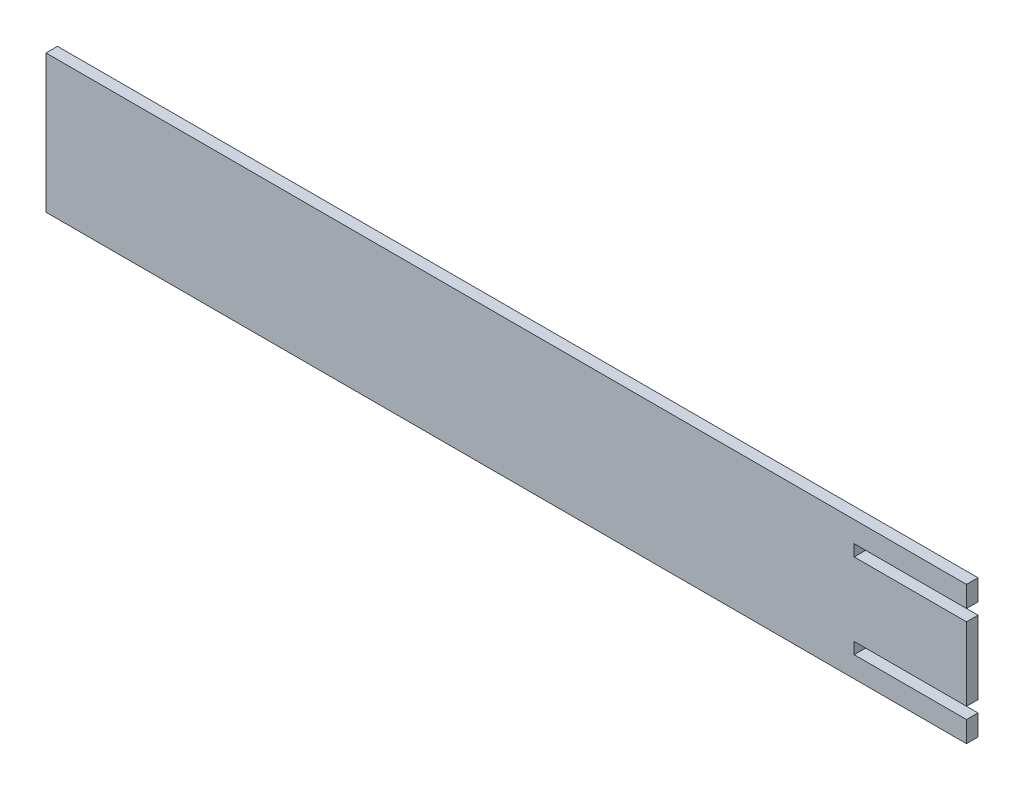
from build123d import *

# Parameters (mm, degrees)
BOSS_EXTRUDE1_DEPTH = 5.5


with BuildPart() as part:
    # Sketch1 → Boss-Extrude1 (new body)
    with BuildSketch(Plane.XY):
        Polygon((0, 110.080469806), (0, 176.080469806), (440.34, 176.080469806), (440.34, 166.080469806), (386.59, 166.080469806), (386.59, 160.580469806), (440.34, 160.580469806), (440.34, 125.580469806), (386.59, 125.580469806), (386.59, 120.080469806), (440.34, 120.080469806), (440.34, 110.080469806), align=None)
    extrude(amount=BOSS_EXTRUDE1_DEPTH)


solid = part.part
